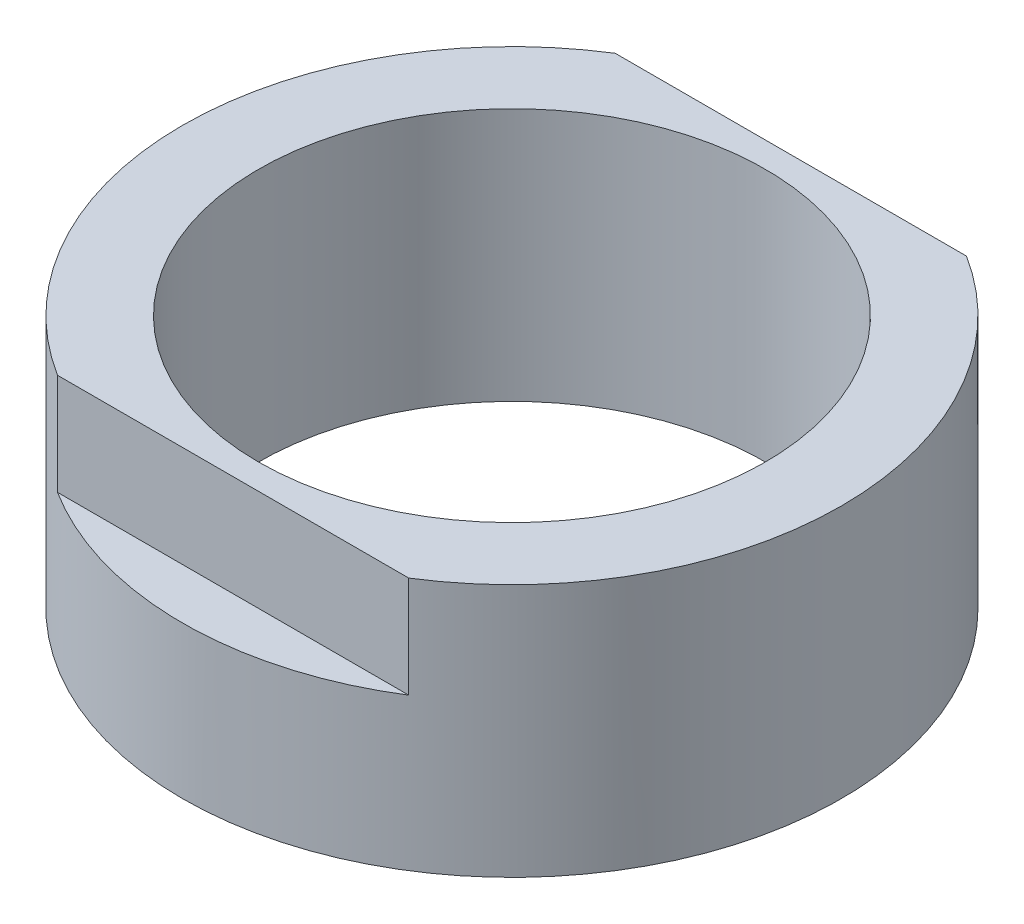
from build123d import *

# Parameters (mm, degrees)
SKETCH1_R           = 6.5
BOSS_EXTRUDE1_DEPTH = 5
SKETCH2_W           = 11.337094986
SKETCH2_H           = 3
SKETCH2_W_2         = 10.803417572
CUT_EXTRUDE1_DEPTH  = 2
SKETCH3_R           = 5
CUT_EXTRUDE2_DEPTH  = 11.464224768


with BuildPart() as part:
    # Sketch1 → Boss-Extrude1 (new body)
    with BuildSketch(Plane(origin=(0, 0, 0), x_dir=(1, 0, 0), z_dir=(0, 1, 0))):
        with Locations(Location((0, 0, 0), (0, 0, 270))):
            Circle(SKETCH1_R)
    extrude(amount=BOSS_EXTRUDE1_DEPTH)

    # Sketch2 → Cut-Extrude1 (cut)
    with BuildSketch(Plane(origin=(0, 5, 0), x_dir=(1, 0, 0), z_dir=(0, 1, 0))):
        with Locations((0, 7)):
            Rectangle(SKETCH2_W, SKETCH2_H)
        with Locations((0, -7)):
            Rectangle(SKETCH2_W_2, SKETCH2_H)
    extrude(amount=-CUT_EXTRUDE1_DEPTH, mode=Mode.SUBTRACT)

    # Sketch3 → Cut-Extrude2 (cut, through all)
    with BuildSketch(Plane(origin=(0, 5, 0), x_dir=(1, 0, 0), z_dir=(0, 1, 0))):
        with Locations(Location((0, 0, 0), (0, 0, 270))):
            Circle(SKETCH3_R)
    extrude(amount=-CUT_EXTRUDE2_DEPTH, mode=Mode.SUBTRACT)


solid = part.part
